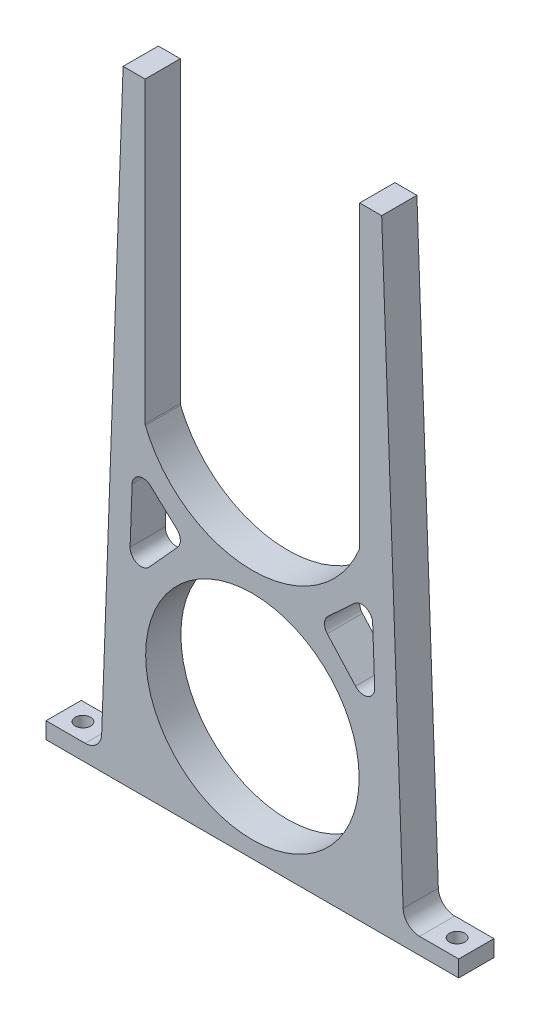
ISO-10303-21;
HEADER;
FILE_DESCRIPTION(('STEP AP214'),'2;1');
FILE_NAME('part.step','',(''),(''),'','','');
FILE_SCHEMA(('AUTOMOTIVE_DESIGN { 1 0 10303 214 1 1 1 1 }'));
ENDSEC;
DATA;
#1=APPLICATION_CONTEXT('core data for automotive mechanical design processes');
#2=APPLICATION_PROTOCOL_DEFINITION('international standard','automotive_design',2000,#1);
#3=PRODUCT_CONTEXT('',#1,'mechanical');
#4=PRODUCT('Part','Part','',(#3));
#5=PRODUCT_RELATED_PRODUCT_CATEGORY('part','',(#4));
#6=PRODUCT_DEFINITION_FORMATION('','',#4);
#7=PRODUCT_DEFINITION_CONTEXT('part definition',#1,'design');
#8=PRODUCT_DEFINITION('design','',#6,#7);
#9=PRODUCT_DEFINITION_SHAPE('','',#8);
#10=(LENGTH_UNIT() NAMED_UNIT(*) SI_UNIT(.MILLI.,.METRE.));
#11=(NAMED_UNIT(*) PLANE_ANGLE_UNIT() SI_UNIT($,.RADIAN.));
#12=(NAMED_UNIT(*) SI_UNIT($,.STERADIAN.) SOLID_ANGLE_UNIT());
#13=UNCERTAINTY_MEASURE_WITH_UNIT(LENGTH_MEASURE(1.E-05),#10,'distance_accuracy_value','');
#14=(GEOMETRIC_REPRESENTATION_CONTEXT(3) GLOBAL_UNCERTAINTY_ASSIGNED_CONTEXT((#13)) GLOBAL_UNIT_ASSIGNED_CONTEXT((#10,
#11,#12)) REPRESENTATION_CONTEXT('',''));
#15=CARTESIAN_POINT('',(0.,0.,0.));
#16=DIRECTION('',(0.,0.,1.));
#17=DIRECTION('',(1.,0.,0.));
#18=AXIS2_PLACEMENT_3D('',#15,#16,#17);
#19=CARTESIAN_POINT('',(0.,66.4,3.2));
#20=DIRECTION('',(0.,0.,-1.));
#21=DIRECTION('',(-1.,0.,0.));
#22=AXIS2_PLACEMENT_3D('',#19,#20,#21);
#23=PLANE('',#22);
#24=CARTESIAN_POINT('',(0.,22.4,3.2));
#25=DIRECTION('',(0.,0.,1.));
#26=DIRECTION('',(-1.,0.,0.));
#27=AXIS2_PLACEMENT_3D('',#24,#25,#26);
#28=CIRCLE('',#27,19.4);
#29=CARTESIAN_POINT('',(-19.4,22.4,3.2));
#30=VERTEX_POINT('',#29);
#31=EDGE_CURVE('E399',#30,#30,#28,.T.);
#32=ORIENTED_EDGE('',*,*,#31,.F.);
#33=EDGE_LOOP('',(#32));
#34=FACE_BOUND('',#33,.T.);
#35=DIRECTION('',(-1.,0.,0.));
#36=VECTOR('',#35,1.);
#37=CARTESIAN_POINT('',(37.5,3.,3.2));
#38=LINE('',#37,#36);
#39=CARTESIAN_POINT('',(37.5,3.,3.2));
#40=VERTEX_POINT('',#39);
#41=CARTESIAN_POINT('',(30.3928919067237,3.,3.2));
#42=VERTEX_POINT('',#41);
#43=EDGE_CURVE('E423',#40,#42,#38,.T.);
#44=ORIENTED_EDGE('',*,*,#43,.T.);
#45=CARTESIAN_POINT('',(30.3928919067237,6.,3.2));
#46=DIRECTION('',(0.,0.,-1.));
#47=DIRECTION('',(-1.,0.,0.));
#48=AXIS2_PLACEMENT_3D('',#45,#46,#47);
#49=CIRCLE('',#48,3.);
#50=CARTESIAN_POINT('',(27.3948734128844,5.89098114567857,3.2));
#51=VERTEX_POINT('',#50);
#52=EDGE_CURVE('E224',#42,#51,#49,.T.);
#53=ORIENTED_EDGE('',*,*,#52,.T.);
#54=DIRECTION('',(-0.036339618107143,0.999339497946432,0.));
#55=VECTOR('',#54,1.);
#56=CARTESIAN_POINT('',(27.5,3.,3.2));
#57=LINE('',#56,#55);
#58=CARTESIAN_POINT('',(23.5,113.,3.2));
#59=VERTEX_POINT('',#58);
#60=EDGE_CURVE('E216',#51,#59,#57,.T.);
#61=ORIENTED_EDGE('',*,*,#60,.T.);
#62=DIRECTION('',(-1.,0.,0.));
#63=VECTOR('',#62,1.);
#64=CARTESIAN_POINT('',(23.5,113.,3.2));
#65=LINE('',#64,#63);
#66=CARTESIAN_POINT('',(19.5,113.,3.2));
#67=VERTEX_POINT('',#66);
#68=EDGE_CURVE('E221',#59,#67,#65,.T.);
#69=ORIENTED_EDGE('',*,*,#68,.T.);
#70=DIRECTION('',(0.,-1.,0.));
#71=VECTOR('',#70,1.);
#72=CARTESIAN_POINT('',(19.5,113.,3.2));
#73=LINE('',#72,#71);
#74=CARTESIAN_POINT('',(19.5,58.7416712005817,3.2));
#75=VERTEX_POINT('',#74);
#76=EDGE_CURVE('E238',#67,#75,#73,.T.);
#77=ORIENTED_EDGE('',*,*,#76,.T.);
#78=CARTESIAN_POINT('',(18.8,58.7416712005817,3.2));
#79=DIRECTION('',(0.,0.,-1.));
#80=DIRECTION('',(-1.,0.,0.));
#81=AXIS2_PLACEMENT_3D('',#78,#79,#80);
#82=CIRCLE('',#81,0.7);
#83=CARTESIAN_POINT('',(19.448275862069,58.4775908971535,3.2));
#84=VERTEX_POINT('',#83);
#85=EDGE_CURVE('E261',#75,#84,#82,.T.);
#86=ORIENTED_EDGE('',*,*,#85,.T.);
#87=CARTESIAN_POINT('',(0.,66.4,3.2));
#88=DIRECTION('',(0.,0.,-1.));
#89=DIRECTION('',(-1.,0.,0.));
#90=AXIS2_PLACEMENT_3D('',#87,#88,#89);
#91=CIRCLE('',#90,21.);
#92=CARTESIAN_POINT('',(-19.448275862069,58.4775908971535,3.2));
#93=VERTEX_POINT('',#92);
#94=EDGE_CURVE('E405',#84,#93,#91,.T.);
#95=ORIENTED_EDGE('',*,*,#94,.T.);
#96=CARTESIAN_POINT('',(-18.8,58.7416712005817,3.2));
#97=DIRECTION('',(0.,0.,-1.));
#98=DIRECTION('',(-1.,0.,0.));
#99=AXIS2_PLACEMENT_3D('',#96,#97,#98);
#100=CIRCLE('',#99,0.7);
#101=CARTESIAN_POINT('',(-19.5,58.7416712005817,3.2));
#102=VERTEX_POINT('',#101);
#103=EDGE_CURVE('E265',#93,#102,#100,.T.);
#104=ORIENTED_EDGE('',*,*,#103,.T.);
#105=DIRECTION('',(0.,1.,0.));
#106=VECTOR('',#105,1.);
#107=CARTESIAN_POINT('',(-19.5,113.,3.2));
#108=LINE('',#107,#106);
#109=CARTESIAN_POINT('',(-19.5,113.,3.2));
#110=VERTEX_POINT('',#109);
#111=EDGE_CURVE('E408',#102,#110,#108,.T.);
#112=ORIENTED_EDGE('',*,*,#111,.T.);
#113=DIRECTION('',(-1.,0.,0.));
#114=VECTOR('',#113,1.);
#115=CARTESIAN_POINT('',(-23.5,113.,3.2));
#116=LINE('',#115,#114);
#117=CARTESIAN_POINT('',(-23.5,113.,3.2));
#118=VERTEX_POINT('',#117);
#119=EDGE_CURVE('E410',#110,#118,#116,.T.);
#120=ORIENTED_EDGE('',*,*,#119,.T.);
#121=DIRECTION('',(-0.036339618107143,-0.999339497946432,0.));
#122=VECTOR('',#121,1.);
#123=CARTESIAN_POINT('',(-27.5,3.,3.2));
#124=LINE('',#123,#122);
#125=CARTESIAN_POINT('',(-27.3948734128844,5.89098114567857,3.2));
#126=VERTEX_POINT('',#125);
#127=EDGE_CURVE('E412',#118,#126,#124,.T.);
#128=ORIENTED_EDGE('',*,*,#127,.T.);
#129=CARTESIAN_POINT('',(-30.3928919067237,6.,3.2));
#130=DIRECTION('',(0.,0.,-1.));
#131=DIRECTION('',(-1.,0.,0.));
#132=AXIS2_PLACEMENT_3D('',#129,#130,#131);
#133=CIRCLE('',#132,3.);
#134=CARTESIAN_POINT('',(-30.3928919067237,3.,3.2));
#135=VERTEX_POINT('',#134);
#136=EDGE_CURVE('E281',#126,#135,#133,.T.);
#137=ORIENTED_EDGE('',*,*,#136,.T.);
#138=DIRECTION('',(-1.,0.,0.));
#139=VECTOR('',#138,1.);
#140=CARTESIAN_POINT('',(-37.5,3.,3.2));
#141=LINE('',#140,#139);
#142=CARTESIAN_POINT('',(-37.5,3.,3.2));
#143=VERTEX_POINT('',#142);
#144=EDGE_CURVE('E415',#135,#143,#141,.T.);
#145=ORIENTED_EDGE('',*,*,#144,.T.);
#146=DIRECTION('',(0.,-1.,0.));
#147=VECTOR('',#146,1.);
#148=CARTESIAN_POINT('',(-37.5,0.,3.2));
#149=LINE('',#148,#147);
#150=CARTESIAN_POINT('',(-37.5,0.,3.2));
#151=VERTEX_POINT('',#150);
#152=EDGE_CURVE('E417',#143,#151,#149,.T.);
#153=ORIENTED_EDGE('',*,*,#152,.T.);
#154=DIRECTION('',(1.,0.,0.));
#155=VECTOR('',#154,1.);
#156=CARTESIAN_POINT('',(-37.5,0.,3.2));
#157=LINE('',#156,#155);
#158=CARTESIAN_POINT('',(37.5,0.,3.2));
#159=VERTEX_POINT('',#158);
#160=EDGE_CURVE('E419',#151,#159,#157,.T.);
#161=ORIENTED_EDGE('',*,*,#160,.T.);
#162=DIRECTION('',(0.,1.,0.));
#163=VECTOR('',#162,1.);
#164=CARTESIAN_POINT('',(37.5,0.,3.2));
#165=LINE('',#164,#163);
#166=EDGE_CURVE('E421',#159,#40,#165,.T.);
#167=ORIENTED_EDGE('',*,*,#166,.T.);
#168=EDGE_LOOP('',(#44,#53,#61,#69,#77,#86,#95,#104,#112,#120,#128,#137,#145,#153,#161,#167));
#169=FACE_BOUND('',#168,.T.);
#170=DIRECTION('',(0.733470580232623,0.679721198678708,0.));
#171=VECTOR('',#170,1.);
#172=CARTESIAN_POINT('',(16.9930299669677,48.0632354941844,3.2));
#173=LINE('',#172,#171);
#174=CARTESIAN_POINT('',(13.7351859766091,45.0441292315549,3.2));
#175=VERTEX_POINT('',#174);
#176=CARTESIAN_POINT('',(18.5004730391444,49.4602117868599,3.2));
#177=VERTEX_POINT('',#176);
#178=EDGE_CURVE('E380',#175,#177,#173,.T.);
#179=ORIENTED_EDGE('',*,*,#178,.T.);
#180=CARTESIAN_POINT('',(19.8599154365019,47.9932706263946,3.2));
#181=DIRECTION('',(0.,0.,-1.));
#182=DIRECTION('',(-1.,0.,0.));
#183=AXIS2_PLACEMENT_3D('',#180,#181,#182);
#184=CIRCLE('',#183,2.);
#185=CARTESIAN_POINT('',(21.8585944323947,48.0659498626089,3.2));
#186=VERTEX_POINT('',#185);
#187=EDGE_CURVE('E311',#177,#186,#184,.T.);
#188=ORIENTED_EDGE('',*,*,#187,.T.);
#189=DIRECTION('',(0.0363396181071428,-0.999339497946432,0.));
#190=VECTOR('',#189,1.);
#191=CARTESIAN_POINT('',(21.1639163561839,67.1695969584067,3.2));
#192=LINE('',#191,#190);
#193=CARTESIAN_POINT('',(22.2255450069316,37.9748090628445,3.2));
#194=VERTEX_POINT('',#193);
#195=EDGE_CURVE('E360',#186,#194,#192,.T.);
#196=ORIENTED_EDGE('',*,*,#195,.T.);
#197=CARTESIAN_POINT('',(20.2268660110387,37.9021298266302,3.2));
#198=DIRECTION('',(0.,0.,-1.));
#199=DIRECTION('',(-1.,0.,0.));
#200=AXIS2_PLACEMENT_3D('',#197,#198,#199);
#201=CIRCLE('',#200,2.);
#202=CARTESIAN_POINT('',(18.7434903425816,36.5606393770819,3.2));
#203=VERTEX_POINT('',#202);
#204=EDGE_CURVE('E307',#194,#203,#201,.T.);
#205=ORIENTED_EDGE('',*,*,#204,.T.);
#206=DIRECTION('',(-0.670745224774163,0.741687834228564,0.));
#207=VECTOR('',#206,1.);
#208=CARTESIAN_POINT('',(-4.53378189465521,62.2998753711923,3.2));
#209=LINE('',#208,#207);
#210=CARTESIAN_POINT('',(13.6112527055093,42.2356976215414,3.2));
#211=VERTEX_POINT('',#210);
#212=EDGE_CURVE('E383',#203,#211,#209,.T.);
#213=ORIENTED_EDGE('',*,*,#212,.T.);
#214=CARTESIAN_POINT('',(15.0946283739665,43.5771880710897,3.2));
#215=DIRECTION('',(0.,0.,-1.));
#216=DIRECTION('',(-1.,0.,0.));
#217=AXIS2_PLACEMENT_3D('',#214,#215,#216);
#218=CIRCLE('',#217,2.);
#219=EDGE_CURVE('E315',#211,#175,#218,.T.);
#220=ORIENTED_EDGE('',*,*,#219,.T.);
#221=EDGE_LOOP('',(#179,#188,#196,#205,#213,#220));
#222=FACE_BOUND('',#221,.T.);
#223=DIRECTION('',(0.670745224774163,0.741687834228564,0.));
#224=VECTOR('',#223,1.);
#225=CARTESIAN_POINT('',(4.53378189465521,62.2998753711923,3.2));
#226=LINE('',#225,#224);
#227=CARTESIAN_POINT('',(-18.7434903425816,36.5606393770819,3.2));
#228=VERTEX_POINT('',#227);
#229=CARTESIAN_POINT('',(-13.6112527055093,42.2356976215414,3.2));
#230=VERTEX_POINT('',#229);
#231=EDGE_CURVE('E351',#228,#230,#226,.T.);
#232=ORIENTED_EDGE('',*,*,#231,.F.);
#233=CARTESIAN_POINT('',(-20.2268660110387,37.9021298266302,3.2));
#234=DIRECTION('',(0.,0.,-1.));
#235=DIRECTION('',(-1.,0.,0.));
#236=AXIS2_PLACEMENT_3D('',#233,#234,#235);
#237=CIRCLE('',#236,2.);
#238=CARTESIAN_POINT('',(-22.2255450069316,37.9748090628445,3.2));
#239=VERTEX_POINT('',#238);
#240=EDGE_CURVE('E340',#228,#239,#237,.T.);
#241=ORIENTED_EDGE('',*,*,#240,.T.);
#242=DIRECTION('',(-0.0363396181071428,-0.999339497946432,0.));
#243=VECTOR('',#242,1.);
#244=CARTESIAN_POINT('',(-21.1639163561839,67.1695969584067,3.2));
#245=LINE('',#244,#243);
#246=CARTESIAN_POINT('',(-21.8585944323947,48.0659498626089,3.2));
#247=VERTEX_POINT('',#246);
#248=EDGE_CURVE('E361',#247,#239,#245,.T.);
#249=ORIENTED_EDGE('',*,*,#248,.F.);
#250=CARTESIAN_POINT('',(-19.8599154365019,47.9932706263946,3.2));
#251=DIRECTION('',(0.,0.,-1.));
#252=DIRECTION('',(-1.,0.,0.));
#253=AXIS2_PLACEMENT_3D('',#250,#251,#252);
#254=CIRCLE('',#253,2.);
#255=CARTESIAN_POINT('',(-18.5004730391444,49.4602117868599,3.2));
#256=VERTEX_POINT('',#255);
#257=EDGE_CURVE('E344',#247,#256,#254,.T.);
#258=ORIENTED_EDGE('',*,*,#257,.T.);
#259=DIRECTION('',(-0.733470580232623,0.679721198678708,0.));
#260=VECTOR('',#259,1.);
#261=CARTESIAN_POINT('',(-16.9930299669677,48.0632354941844,3.2));
#262=LINE('',#261,#260);
#263=CARTESIAN_POINT('',(-13.7351859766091,45.0441292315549,3.2));
#264=VERTEX_POINT('',#263);
#265=EDGE_CURVE('E352',#264,#256,#262,.T.);
#266=ORIENTED_EDGE('',*,*,#265,.F.);
#267=CARTESIAN_POINT('',(-15.0946283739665,43.5771880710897,3.2));
#268=DIRECTION('',(0.,0.,-1.));
#269=DIRECTION('',(-1.,0.,0.));
#270=AXIS2_PLACEMENT_3D('',#267,#268,#269);
#271=CIRCLE('',#270,2.);
#272=EDGE_CURVE('E40',#264,#230,#271,.T.);
#273=ORIENTED_EDGE('',*,*,#272,.T.);
#274=EDGE_LOOP('',(#232,#241,#249,#258,#266,#273));
#275=FACE_BOUND('',#274,.T.);
#276=ADVANCED_FACE('F32',(#34,#169,#222,#275),#23,.F.);
#277=CARTESIAN_POINT('',(0.,66.4,-3.2));
#278=DIRECTION('',(0.,0.,-1.));
#279=DIRECTION('',(-1.,0.,0.));
#280=AXIS2_PLACEMENT_3D('',#277,#278,#279);
#281=PLANE('',#280);
#282=CARTESIAN_POINT('',(0.,22.4,-3.2));
#283=DIRECTION('',(0.,0.,1.));
#284=DIRECTION('',(-1.,0.,0.));
#285=AXIS2_PLACEMENT_3D('',#282,#283,#284);
#286=CIRCLE('',#285,19.4);
#287=CARTESIAN_POINT('',(-19.4,22.4,-3.2));
#288=VERTEX_POINT('',#287);
#289=EDGE_CURVE('E398',#288,#288,#286,.T.);
#290=ORIENTED_EDGE('',*,*,#289,.T.);
#291=EDGE_LOOP('',(#290));
#292=FACE_BOUND('',#291,.T.);
#293=DIRECTION('',(-0.036339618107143,0.999339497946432,0.));
#294=VECTOR('',#293,1.);
#295=CARTESIAN_POINT('',(27.5,3.,-3.2));
#296=LINE('',#295,#294);
#297=CARTESIAN_POINT('',(27.3948734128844,5.89098114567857,-3.2));
#298=VERTEX_POINT('',#297);
#299=CARTESIAN_POINT('',(23.5,113.,-3.2));
#300=VERTEX_POINT('',#299);
#301=EDGE_CURVE('E242',#298,#300,#296,.T.);
#302=ORIENTED_EDGE('',*,*,#301,.F.);
#303=CARTESIAN_POINT('',(30.3928919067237,6.,-3.2));
#304=DIRECTION('',(0.,0.,-1.));
#305=DIRECTION('',(-1.,0.,0.));
#306=AXIS2_PLACEMENT_3D('',#303,#304,#305);
#307=CIRCLE('',#306,3.);
#308=CARTESIAN_POINT('',(30.3928919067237,3.,-3.2));
#309=VERTEX_POINT('',#308);
#310=EDGE_CURVE('E276',#298,#309,#307,.F.);
#311=ORIENTED_EDGE('',*,*,#310,.T.);
#312=DIRECTION('',(-1.,0.,0.));
#313=VECTOR('',#312,1.);
#314=CARTESIAN_POINT('',(37.5,3.,-3.2));
#315=LINE('',#314,#313);
#316=CARTESIAN_POINT('',(37.5,3.,-3.2));
#317=VERTEX_POINT('',#316);
#318=EDGE_CURVE('E229',#317,#309,#315,.T.);
#319=ORIENTED_EDGE('',*,*,#318,.F.);
#320=DIRECTION('',(0.,1.,0.));
#321=VECTOR('',#320,1.);
#322=CARTESIAN_POINT('',(37.5,0.,-3.2));
#323=LINE('',#322,#321);
#324=CARTESIAN_POINT('',(37.5,0.,-3.2));
#325=VERTEX_POINT('',#324);
#326=EDGE_CURVE('E448',#325,#317,#323,.T.);
#327=ORIENTED_EDGE('',*,*,#326,.F.);
#328=DIRECTION('',(1.,0.,0.));
#329=VECTOR('',#328,1.);
#330=CARTESIAN_POINT('',(-37.5,0.,-3.2));
#331=LINE('',#330,#329);
#332=CARTESIAN_POINT('',(-37.5,0.,-3.2));
#333=VERTEX_POINT('',#332);
#334=EDGE_CURVE('E446',#333,#325,#331,.T.);
#335=ORIENTED_EDGE('',*,*,#334,.F.);
#336=DIRECTION('',(0.,-1.,0.));
#337=VECTOR('',#336,1.);
#338=CARTESIAN_POINT('',(-37.5,0.,-3.2));
#339=LINE('',#338,#337);
#340=CARTESIAN_POINT('',(-37.5,3.,-3.2));
#341=VERTEX_POINT('',#340);
#342=EDGE_CURVE('E444',#341,#333,#339,.T.);
#343=ORIENTED_EDGE('',*,*,#342,.F.);
#344=DIRECTION('',(-1.,0.,0.));
#345=VECTOR('',#344,1.);
#346=CARTESIAN_POINT('',(-37.5,3.,-3.2));
#347=LINE('',#346,#345);
#348=CARTESIAN_POINT('',(-30.3928919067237,3.,-3.2));
#349=VERTEX_POINT('',#348);
#350=EDGE_CURVE('E442',#349,#341,#347,.T.);
#351=ORIENTED_EDGE('',*,*,#350,.F.);
#352=CARTESIAN_POINT('',(-30.3928919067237,6.,-3.2));
#353=DIRECTION('',(0.,0.,-1.));
#354=DIRECTION('',(-1.,0.,0.));
#355=AXIS2_PLACEMENT_3D('',#352,#353,#354);
#356=CIRCLE('',#355,3.);
#357=CARTESIAN_POINT('',(-27.3948734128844,5.89098114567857,-3.2));
#358=VERTEX_POINT('',#357);
#359=EDGE_CURVE('E279',#349,#358,#356,.F.);
#360=ORIENTED_EDGE('',*,*,#359,.T.);
#361=DIRECTION('',(-0.036339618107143,-0.999339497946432,0.));
#362=VECTOR('',#361,1.);
#363=CARTESIAN_POINT('',(-27.5,3.,-3.2));
#364=LINE('',#363,#362);
#365=CARTESIAN_POINT('',(-23.5,113.,-3.2));
#366=VERTEX_POINT('',#365);
#367=EDGE_CURVE('E439',#366,#358,#364,.T.);
#368=ORIENTED_EDGE('',*,*,#367,.F.);
#369=DIRECTION('',(-1.,0.,0.));
#370=VECTOR('',#369,1.);
#371=CARTESIAN_POINT('',(-23.5,113.,-3.2));
#372=LINE('',#371,#370);
#373=CARTESIAN_POINT('',(-19.5,113.,-3.2));
#374=VERTEX_POINT('',#373);
#375=EDGE_CURVE('E437',#374,#366,#372,.T.);
#376=ORIENTED_EDGE('',*,*,#375,.F.);
#377=DIRECTION('',(0.,1.,0.));
#378=VECTOR('',#377,1.);
#379=CARTESIAN_POINT('',(-19.5,113.,-3.2));
#380=LINE('',#379,#378);
#381=CARTESIAN_POINT('',(-19.5,58.7416712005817,-3.2));
#382=VERTEX_POINT('',#381);
#383=EDGE_CURVE('E435',#382,#374,#380,.T.);
#384=ORIENTED_EDGE('',*,*,#383,.F.);
#385=CARTESIAN_POINT('',(-18.8,58.7416712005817,-3.2));
#386=DIRECTION('',(0.,0.,-1.));
#387=DIRECTION('',(-1.,0.,0.));
#388=AXIS2_PLACEMENT_3D('',#385,#386,#387);
#389=CIRCLE('',#388,0.7);
#390=CARTESIAN_POINT('',(-19.448275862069,58.4775908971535,-3.2));
#391=VERTEX_POINT('',#390);
#392=EDGE_CURVE('E263',#382,#391,#389,.F.);
#393=ORIENTED_EDGE('',*,*,#392,.T.);
#394=CARTESIAN_POINT('',(0.,66.4,-3.2));
#395=DIRECTION('',(0.,0.,-1.));
#396=DIRECTION('',(-1.,0.,0.));
#397=AXIS2_PLACEMENT_3D('',#394,#395,#396);
#398=CIRCLE('',#397,21.);
#399=CARTESIAN_POINT('',(19.448275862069,58.4775908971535,-3.2));
#400=VERTEX_POINT('',#399);
#401=EDGE_CURVE('E432',#400,#391,#398,.T.);
#402=ORIENTED_EDGE('',*,*,#401,.F.);
#403=CARTESIAN_POINT('',(18.8,58.7416712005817,-3.2));
#404=DIRECTION('',(0.,0.,-1.));
#405=DIRECTION('',(-1.,0.,0.));
#406=AXIS2_PLACEMENT_3D('',#403,#404,#405);
#407=CIRCLE('',#406,0.7);
#408=CARTESIAN_POINT('',(19.5,58.7416712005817,-3.2));
#409=VERTEX_POINT('',#408);
#410=EDGE_CURVE('E259',#400,#409,#407,.F.);
#411=ORIENTED_EDGE('',*,*,#410,.T.);
#412=DIRECTION('',(0.,-1.,0.));
#413=VECTOR('',#412,1.);
#414=CARTESIAN_POINT('',(19.5,113.,-3.2));
#415=LINE('',#414,#413);
#416=CARTESIAN_POINT('',(19.5,113.,-3.2));
#417=VERTEX_POINT('',#416);
#418=EDGE_CURVE('E429',#417,#409,#415,.T.);
#419=ORIENTED_EDGE('',*,*,#418,.F.);
#420=DIRECTION('',(-1.,0.,0.));
#421=VECTOR('',#420,1.);
#422=CARTESIAN_POINT('',(23.5,113.,-3.2));
#423=LINE('',#422,#421);
#424=EDGE_CURVE('E427',#300,#417,#423,.T.);
#425=ORIENTED_EDGE('',*,*,#424,.F.);
#426=EDGE_LOOP('',(#302,#311,#319,#327,#335,#343,#351,#360,#368,#376,#384,#393,#402,#411,#419,#425));
#427=FACE_BOUND('',#426,.T.);
#428=DIRECTION('',(-0.670745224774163,0.741687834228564,0.));
#429=VECTOR('',#428,1.);
#430=CARTESIAN_POINT('',(-4.53378189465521,62.2998753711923,-3.2));
#431=LINE('',#430,#429);
#432=CARTESIAN_POINT('',(18.7434903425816,36.5606393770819,-3.2));
#433=VERTEX_POINT('',#432);
#434=CARTESIAN_POINT('',(13.6112527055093,42.2356976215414,-3.2));
#435=VERTEX_POINT('',#434);
#436=EDGE_CURVE('E289',#433,#435,#431,.T.);
#437=ORIENTED_EDGE('',*,*,#436,.F.);
#438=CARTESIAN_POINT('',(20.2268660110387,37.9021298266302,-3.2));
#439=DIRECTION('',(0.,0.,-1.));
#440=DIRECTION('',(-1.,0.,0.));
#441=AXIS2_PLACEMENT_3D('',#438,#439,#440);
#442=CIRCLE('',#441,2.);
#443=CARTESIAN_POINT('',(22.2255450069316,37.9748090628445,-3.2));
#444=VERTEX_POINT('',#443);
#445=EDGE_CURVE('E309',#433,#444,#442,.F.);
#446=ORIENTED_EDGE('',*,*,#445,.T.);
#447=DIRECTION('',(0.0363396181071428,-0.999339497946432,0.));
#448=VECTOR('',#447,1.);
#449=CARTESIAN_POINT('',(21.1639163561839,67.1695969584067,-3.2));
#450=LINE('',#449,#448);
#451=CARTESIAN_POINT('',(21.8585944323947,48.0659498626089,-3.2));
#452=VERTEX_POINT('',#451);
#453=EDGE_CURVE('E283',#452,#444,#450,.T.);
#454=ORIENTED_EDGE('',*,*,#453,.F.);
#455=CARTESIAN_POINT('',(19.8599154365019,47.9932706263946,-3.2));
#456=DIRECTION('',(0.,0.,-1.));
#457=DIRECTION('',(-1.,0.,0.));
#458=AXIS2_PLACEMENT_3D('',#455,#456,#457);
#459=CIRCLE('',#458,2.);
#460=CARTESIAN_POINT('',(18.5004730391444,49.4602117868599,-3.2));
#461=VERTEX_POINT('',#460);
#462=EDGE_CURVE('E313',#452,#461,#459,.F.);
#463=ORIENTED_EDGE('',*,*,#462,.T.);
#464=DIRECTION('',(0.733470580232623,0.679721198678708,0.));
#465=VECTOR('',#464,1.);
#466=CARTESIAN_POINT('',(16.9930299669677,48.0632354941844,-3.2));
#467=LINE('',#466,#465);
#468=CARTESIAN_POINT('',(13.7351859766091,45.0441292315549,-3.2));
#469=VERTEX_POINT('',#468);
#470=EDGE_CURVE('E286',#469,#461,#467,.T.);
#471=ORIENTED_EDGE('',*,*,#470,.F.);
#472=CARTESIAN_POINT('',(15.0946283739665,43.5771880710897,-3.2));
#473=DIRECTION('',(0.,0.,-1.));
#474=DIRECTION('',(-1.,0.,0.));
#475=AXIS2_PLACEMENT_3D('',#472,#473,#474);
#476=CIRCLE('',#475,2.);
#477=EDGE_CURVE('E317',#469,#435,#476,.F.);
#478=ORIENTED_EDGE('',*,*,#477,.T.);
#479=EDGE_LOOP('',(#437,#446,#454,#463,#471,#478));
#480=FACE_BOUND('',#479,.T.);
#481=DIRECTION('',(-0.733470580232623,0.679721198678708,0.));
#482=VECTOR('',#481,1.);
#483=CARTESIAN_POINT('',(-16.9930299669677,48.0632354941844,-3.2));
#484=LINE('',#483,#482);
#485=CARTESIAN_POINT('',(-13.7351859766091,45.0441292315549,-3.2));
#486=VERTEX_POINT('',#485);
#487=CARTESIAN_POINT('',(-18.5004730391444,49.4602117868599,-3.2));
#488=VERTEX_POINT('',#487);
#489=EDGE_CURVE('E319',#486,#488,#484,.T.);
#490=ORIENTED_EDGE('',*,*,#489,.T.);
#491=CARTESIAN_POINT('',(-19.8599154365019,47.9932706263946,-3.2));
#492=DIRECTION('',(0.,0.,-1.));
#493=DIRECTION('',(-1.,0.,0.));
#494=AXIS2_PLACEMENT_3D('',#491,#492,#493);
#495=CIRCLE('',#494,2.);
#496=CARTESIAN_POINT('',(-21.8585944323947,48.0659498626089,-3.2));
#497=VERTEX_POINT('',#496);
#498=EDGE_CURVE('E346',#488,#497,#495,.F.);
#499=ORIENTED_EDGE('',*,*,#498,.T.);
#500=DIRECTION('',(-0.0363396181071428,-0.999339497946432,0.));
#501=VECTOR('',#500,1.);
#502=CARTESIAN_POINT('',(-21.1639163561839,67.1695969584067,-3.2));
#503=LINE('',#502,#501);
#504=CARTESIAN_POINT('',(-22.2255450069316,37.9748090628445,-3.2));
#505=VERTEX_POINT('',#504);
#506=EDGE_CURVE('E321',#497,#505,#503,.T.);
#507=ORIENTED_EDGE('',*,*,#506,.T.);
#508=CARTESIAN_POINT('',(-20.2268660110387,37.9021298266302,-3.2));
#509=DIRECTION('',(0.,0.,-1.));
#510=DIRECTION('',(-1.,0.,0.));
#511=AXIS2_PLACEMENT_3D('',#508,#509,#510);
#512=CIRCLE('',#511,2.);
#513=CARTESIAN_POINT('',(-18.7434903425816,36.5606393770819,-3.2));
#514=VERTEX_POINT('',#513);
#515=EDGE_CURVE('E342',#505,#514,#512,.F.);
#516=ORIENTED_EDGE('',*,*,#515,.T.);
#517=DIRECTION('',(0.670745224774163,0.741687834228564,0.));
#518=VECTOR('',#517,1.);
#519=CARTESIAN_POINT('',(4.53378189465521,62.2998753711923,-3.2));
#520=LINE('',#519,#518);
#521=CARTESIAN_POINT('',(-13.6112527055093,42.2356976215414,-3.2));
#522=VERTEX_POINT('',#521);
#523=EDGE_CURVE('E324',#514,#522,#520,.T.);
#524=ORIENTED_EDGE('',*,*,#523,.T.);
#525=CARTESIAN_POINT('',(-15.0946283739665,43.5771880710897,-3.2));
#526=DIRECTION('',(0.,0.,-1.));
#527=DIRECTION('',(-1.,0.,0.));
#528=AXIS2_PLACEMENT_3D('',#525,#526,#527);
#529=CIRCLE('',#528,2.);
#530=EDGE_CURVE('E11',#522,#486,#529,.F.);
#531=ORIENTED_EDGE('',*,*,#530,.T.);
#532=EDGE_LOOP('',(#490,#499,#507,#516,#524,#531));
#533=FACE_BOUND('',#532,.T.);
#534=ADVANCED_FACE('F365',(#292,#427,#480,#533),#281,.T.);
#535=CARTESIAN_POINT('',(-37.5,0.,3.2));
#536=DIRECTION('',(0.,1.,0.));
#537=DIRECTION('',(0.,0.,1.));
#538=AXIS2_PLACEMENT_3D('',#535,#536,#537);
#539=PLANE('',#538);
#540=CARTESIAN_POINT('',(34.,0.,0.));
#541=DIRECTION('',(0.,1.,0.));
#542=DIRECTION('',(0.,0.,1.));
#543=AXIS2_PLACEMENT_3D('',#540,#541,#542);
#544=CIRCLE('',#543,1.4);
#545=CARTESIAN_POINT('',(34.,0.,1.4));
#546=VERTEX_POINT('',#545);
#547=EDGE_CURVE('E395',#546,#546,#544,.T.);
#548=ORIENTED_EDGE('',*,*,#547,.T.);
#549=EDGE_LOOP('',(#548));
#550=FACE_BOUND('',#549,.T.);
#551=ORIENTED_EDGE('',*,*,#334,.T.);
#552=DIRECTION('',(0.,0.,-1.));
#553=VECTOR('',#552,1.);
#554=CARTESIAN_POINT('',(37.5,0.,3.2));
#555=LINE('',#554,#553);
#556=EDGE_CURVE('E454',#159,#325,#555,.T.);
#557=ORIENTED_EDGE('',*,*,#556,.F.);
#558=ORIENTED_EDGE('',*,*,#160,.F.);
#559=DIRECTION('',(0.,0.,-1.));
#560=VECTOR('',#559,1.);
#561=CARTESIAN_POINT('',(-37.5,0.,3.2));
#562=LINE('',#561,#560);
#563=EDGE_CURVE('E457',#151,#333,#562,.T.);
#564=ORIENTED_EDGE('',*,*,#563,.T.);
#565=EDGE_LOOP('',(#551,#557,#558,#564));
#566=FACE_BOUND('',#565,.T.);
#567=CARTESIAN_POINT('',(-34.,0.,0.));
#568=DIRECTION('',(0.,-1.,0.));
#569=DIRECTION('',(0.,0.,1.));
#570=AXIS2_PLACEMENT_3D('',#567,#568,#569);
#571=CIRCLE('',#570,1.4);
#572=CARTESIAN_POINT('',(-34.,0.,1.4));
#573=VERTEX_POINT('',#572);
#574=EDGE_CURVE('E389',#573,#573,#571,.T.);
#575=ORIENTED_EDGE('',*,*,#574,.F.);
#576=EDGE_LOOP('',(#575));
#577=FACE_BOUND('',#576,.T.);
#578=ADVANCED_FACE('F502',(#550,#566,#577),#539,.F.);
#579=CARTESIAN_POINT('',(-37.5,3.,3.2));
#580=DIRECTION('',(0.,-1.,0.));
#581=DIRECTION('',(1.,0.,0.));
#582=AXIS2_PLACEMENT_3D('',#579,#580,#581);
#583=PLANE('',#582);
#584=ORIENTED_EDGE('',*,*,#144,.F.);
#585=DIRECTION('',(0.,0.,-1.));
#586=VECTOR('',#585,1.);
#587=CARTESIAN_POINT('',(-30.3928919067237,3.,-3.2));
#588=LINE('',#587,#586);
#589=EDGE_CURVE('E271',#135,#349,#588,.T.);
#590=ORIENTED_EDGE('',*,*,#589,.T.);
#591=ORIENTED_EDGE('',*,*,#350,.T.);
#592=DIRECTION('',(0.,0.,-1.));
#593=VECTOR('',#592,1.);
#594=CARTESIAN_POINT('',(-37.5,3.,3.2));
#595=LINE('',#594,#593);
#596=EDGE_CURVE('E460',#143,#341,#595,.T.);
#597=ORIENTED_EDGE('',*,*,#596,.F.);
#598=EDGE_LOOP('',(#584,#590,#591,#597));
#599=FACE_BOUND('',#598,.T.);
#600=CARTESIAN_POINT('',(-34.,3.,0.));
#601=DIRECTION('',(0.,-1.,0.));
#602=DIRECTION('',(0.,0.,1.));
#603=AXIS2_PLACEMENT_3D('',#600,#601,#602);
#604=CIRCLE('',#603,1.4);
#605=CARTESIAN_POINT('',(-34.,3.,1.4));
#606=VERTEX_POINT('',#605);
#607=EDGE_CURVE('E386',#606,#606,#604,.T.);
#608=ORIENTED_EDGE('',*,*,#607,.T.);
#609=EDGE_LOOP('',(#608));
#610=FACE_BOUND('',#609,.T.);
#611=ADVANCED_FACE('F490',(#599,#610),#583,.F.);
#612=CARTESIAN_POINT('',(37.5,3.,3.2));
#613=DIRECTION('',(0.,-1.,0.));
#614=DIRECTION('',(1.,0.,0.));
#615=AXIS2_PLACEMENT_3D('',#612,#613,#614);
#616=PLANE('',#615);
#617=ORIENTED_EDGE('',*,*,#318,.T.);
#618=DIRECTION('',(0.,0.,-1.));
#619=VECTOR('',#618,1.);
#620=CARTESIAN_POINT('',(30.3928919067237,3.,3.2));
#621=LINE('',#620,#619);
#622=EDGE_CURVE('E269',#309,#42,#621,.F.);
#623=ORIENTED_EDGE('',*,*,#622,.T.);
#624=ORIENTED_EDGE('',*,*,#43,.F.);
#625=DIRECTION('',(0.,0.,-1.));
#626=VECTOR('',#625,1.);
#627=CARTESIAN_POINT('',(37.5,3.,3.2));
#628=LINE('',#627,#626);
#629=EDGE_CURVE('E425',#40,#317,#628,.T.);
#630=ORIENTED_EDGE('',*,*,#629,.T.);
#631=EDGE_LOOP('',(#617,#623,#624,#630));
#632=FACE_BOUND('',#631,.T.);
#633=CARTESIAN_POINT('',(34.,3.,0.));
#634=DIRECTION('',(0.,1.,0.));
#635=DIRECTION('',(0.,0.,1.));
#636=AXIS2_PLACEMENT_3D('',#633,#634,#635);
#637=CIRCLE('',#636,1.4);
#638=CARTESIAN_POINT('',(34.,3.,1.4));
#639=VERTEX_POINT('',#638);
#640=EDGE_CURVE('E392',#639,#639,#637,.T.);
#641=ORIENTED_EDGE('',*,*,#640,.F.);
#642=EDGE_LOOP('',(#641));
#643=FACE_BOUND('',#642,.T.);
#644=ADVANCED_FACE('F511',(#632,#643),#616,.F.);
#645=CARTESIAN_POINT('',(27.5,3.,3.2));
#646=DIRECTION('',(-0.999339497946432,-0.036339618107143,0.));
#647=DIRECTION('',(0.036339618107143,-0.999339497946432,0.));
#648=AXIS2_PLACEMENT_3D('',#645,#646,#647);
#649=PLANE('',#648);
#650=ORIENTED_EDGE('',*,*,#60,.F.);
#651=DIRECTION('',(0.,0.,-1.));
#652=VECTOR('',#651,1.);
#653=CARTESIAN_POINT('',(27.3948734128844,5.89098114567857,-3.2));
#654=LINE('',#653,#652);
#655=EDGE_CURVE('E267',#51,#298,#654,.T.);
#656=ORIENTED_EDGE('',*,*,#655,.T.);
#657=ORIENTED_EDGE('',*,*,#301,.T.);
#658=DIRECTION('',(0.,0.,-1.));
#659=VECTOR('',#658,1.);
#660=CARTESIAN_POINT('',(23.5,113.,3.2));
#661=LINE('',#660,#659);
#662=EDGE_CURVE('E234',#59,#300,#661,.T.);
#663=ORIENTED_EDGE('',*,*,#662,.F.);
#664=EDGE_LOOP('',(#650,#656,#657,#663));
#665=FACE_BOUND('',#664,.T.);
#666=ADVANCED_FACE('F240',(#665),#649,.F.);
#667=CARTESIAN_POINT('',(23.5,113.,3.2));
#668=DIRECTION('',(0.,-1.,0.));
#669=DIRECTION('',(0.,0.,-1.));
#670=AXIS2_PLACEMENT_3D('',#667,#668,#669);
#671=PLANE('',#670);
#672=ORIENTED_EDGE('',*,*,#424,.T.);
#673=DIRECTION('',(0.,0.,-1.));
#674=VECTOR('',#673,1.);
#675=CARTESIAN_POINT('',(19.5,113.,3.2));
#676=LINE('',#675,#674);
#677=EDGE_CURVE('E236',#67,#417,#676,.T.);
#678=ORIENTED_EDGE('',*,*,#677,.F.);
#679=ORIENTED_EDGE('',*,*,#68,.F.);
#680=ORIENTED_EDGE('',*,*,#662,.T.);
#681=EDGE_LOOP('',(#672,#678,#679,#680));
#682=FACE_BOUND('',#681,.T.);
#683=ADVANCED_FACE('F233',(#682),#671,.F.);
#684=CARTESIAN_POINT('',(19.5,113.,3.2));
#685=DIRECTION('',(1.,0.,0.));
#686=DIRECTION('',(0.,1.,0.));
#687=AXIS2_PLACEMENT_3D('',#684,#685,#686);
#688=PLANE('',#687);
#689=ORIENTED_EDGE('',*,*,#418,.T.);
#690=DIRECTION('',(0.,0.,1.));
#691=VECTOR('',#690,1.);
#692=CARTESIAN_POINT('',(19.5,58.7416712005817,3.2));
#693=LINE('',#692,#691);
#694=EDGE_CURVE('E254',#409,#75,#693,.T.);
#695=ORIENTED_EDGE('',*,*,#694,.T.);
#696=ORIENTED_EDGE('',*,*,#76,.F.);
#697=ORIENTED_EDGE('',*,*,#677,.T.);
#698=EDGE_LOOP('',(#689,#695,#696,#697));
#699=FACE_BOUND('',#698,.T.);
#700=ADVANCED_FACE('F518',(#699),#688,.F.);
#701=CARTESIAN_POINT('',(0.,66.4,3.2));
#702=DIRECTION('',(0.,0.,-1.));
#703=DIRECTION('',(-1.,0.,0.));
#704=AXIS2_PLACEMENT_3D('',#701,#702,#703);
#705=CYLINDRICAL_SURFACE('',#704,21.);
#706=ORIENTED_EDGE('',*,*,#94,.F.);
#707=DIRECTION('',(0.,0.,-1.));
#708=VECTOR('',#707,1.);
#709=CARTESIAN_POINT('',(19.448275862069,58.4775908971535,3.2));
#710=LINE('',#709,#708);
#711=EDGE_CURVE('E246',#84,#400,#710,.T.);
#712=ORIENTED_EDGE('',*,*,#711,.T.);
#713=ORIENTED_EDGE('',*,*,#401,.T.);
#714=DIRECTION('',(0.,0.,-1.));
#715=VECTOR('',#714,1.);
#716=CARTESIAN_POINT('',(-19.448275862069,58.4775908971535,3.2));
#717=LINE('',#716,#715);
#718=EDGE_CURVE('E244',#391,#93,#717,.F.);
#719=ORIENTED_EDGE('',*,*,#718,.T.);
#720=EDGE_LOOP('',(#706,#712,#713,#719));
#721=FACE_BOUND('',#720,.T.);
#722=ADVANCED_FACE('F527',(#721),#705,.F.);
#723=CARTESIAN_POINT('',(-19.5,113.,3.2));
#724=DIRECTION('',(-1.,0.,0.));
#725=DIRECTION('',(0.,-1.,0.));
#726=AXIS2_PLACEMENT_3D('',#723,#724,#725);
#727=PLANE('',#726);
#728=ORIENTED_EDGE('',*,*,#111,.F.);
#729=DIRECTION('',(0.,0.,1.));
#730=VECTOR('',#729,1.);
#731=CARTESIAN_POINT('',(-19.5,58.7416712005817,-3.2));
#732=LINE('',#731,#730);
#733=EDGE_CURVE('E256',#102,#382,#732,.F.);
#734=ORIENTED_EDGE('',*,*,#733,.T.);
#735=ORIENTED_EDGE('',*,*,#383,.T.);
#736=DIRECTION('',(0.,0.,-1.));
#737=VECTOR('',#736,1.);
#738=CARTESIAN_POINT('',(-19.5,113.,3.2));
#739=LINE('',#738,#737);
#740=EDGE_CURVE('E248',#110,#374,#739,.T.);
#741=ORIENTED_EDGE('',*,*,#740,.F.);
#742=EDGE_LOOP('',(#728,#734,#735,#741));
#743=FACE_BOUND('',#742,.T.);
#744=ADVANCED_FACE('F533',(#743),#727,.F.);
#745=CARTESIAN_POINT('',(-23.5,113.,3.2));
#746=DIRECTION('',(0.,-1.,0.));
#747=DIRECTION('',(0.,0.,-1.));
#748=AXIS2_PLACEMENT_3D('',#745,#746,#747);
#749=PLANE('',#748);
#750=ORIENTED_EDGE('',*,*,#375,.T.);
#751=DIRECTION('',(0.,0.,-1.));
#752=VECTOR('',#751,1.);
#753=CARTESIAN_POINT('',(-23.5,113.,3.2));
#754=LINE('',#753,#752);
#755=EDGE_CURVE('E463',#118,#366,#754,.T.);
#756=ORIENTED_EDGE('',*,*,#755,.F.);
#757=ORIENTED_EDGE('',*,*,#119,.F.);
#758=ORIENTED_EDGE('',*,*,#740,.T.);
#759=EDGE_LOOP('',(#750,#756,#757,#758));
#760=FACE_BOUND('',#759,.T.);
#761=ADVANCED_FACE('F470',(#760),#749,.F.);
#762=CARTESIAN_POINT('',(-27.5,3.,3.2));
#763=DIRECTION('',(0.999339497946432,-0.036339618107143,0.));
#764=DIRECTION('',(0.036339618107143,0.999339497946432,0.));
#765=AXIS2_PLACEMENT_3D('',#762,#763,#764);
#766=PLANE('',#765);
#767=ORIENTED_EDGE('',*,*,#367,.T.);
#768=DIRECTION('',(0.,0.,-1.));
#769=VECTOR('',#768,1.);
#770=CARTESIAN_POINT('',(-27.3948734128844,5.89098114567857,3.2));
#771=LINE('',#770,#769);
#772=EDGE_CURVE('E274',#358,#126,#771,.F.);
#773=ORIENTED_EDGE('',*,*,#772,.T.);
#774=ORIENTED_EDGE('',*,*,#127,.F.);
#775=ORIENTED_EDGE('',*,*,#755,.T.);
#776=EDGE_LOOP('',(#767,#773,#774,#775));
#777=FACE_BOUND('',#776,.T.);
#778=ADVANCED_FACE('F481',(#777),#766,.F.);
#779=CARTESIAN_POINT('',(-37.5,0.,3.2));
#780=DIRECTION('',(1.,0.,0.));
#781=DIRECTION('',(0.,0.,-1.));
#782=AXIS2_PLACEMENT_3D('',#779,#780,#781);
#783=PLANE('',#782);
#784=ORIENTED_EDGE('',*,*,#342,.T.);
#785=ORIENTED_EDGE('',*,*,#563,.F.);
#786=ORIENTED_EDGE('',*,*,#152,.F.);
#787=ORIENTED_EDGE('',*,*,#596,.T.);
#788=EDGE_LOOP('',(#784,#785,#786,#787));
#789=FACE_BOUND('',#788,.T.);
#790=ADVANCED_FACE('F496',(#789),#783,.F.);
#791=CARTESIAN_POINT('',(37.5,0.,3.2));
#792=DIRECTION('',(-1.,0.,0.));
#793=DIRECTION('',(0.,0.,1.));
#794=AXIS2_PLACEMENT_3D('',#791,#792,#793);
#795=PLANE('',#794);
#796=ORIENTED_EDGE('',*,*,#326,.T.);
#797=ORIENTED_EDGE('',*,*,#629,.F.);
#798=ORIENTED_EDGE('',*,*,#166,.F.);
#799=ORIENTED_EDGE('',*,*,#556,.T.);
#800=EDGE_LOOP('',(#796,#797,#798,#799));
#801=FACE_BOUND('',#800,.T.);
#802=ADVANCED_FACE('F507',(#801),#795,.F.);
#803=CARTESIAN_POINT('',(0.,22.4,3.2));
#804=DIRECTION('',(0.,0.,-1.));
#805=DIRECTION('',(-1.,0.,0.));
#806=AXIS2_PLACEMENT_3D('',#803,#804,#805);
#807=CYLINDRICAL_SURFACE('',#806,19.4);
#808=ORIENTED_EDGE('',*,*,#31,.T.);
#809=EDGE_LOOP('',(#808));
#810=FACE_BOUND('',#809,.T.);
#811=ORIENTED_EDGE('',*,*,#289,.F.);
#812=EDGE_LOOP('',(#811));
#813=FACE_BOUND('',#812,.T.);
#814=ADVANCED_FACE('F552',(#810,#813),#807,.F.);
#815=CARTESIAN_POINT('',(34.,3.,0.));
#816=DIRECTION('',(0.,1.,0.));
#817=DIRECTION('',(0.,0.,1.));
#818=AXIS2_PLACEMENT_3D('',#815,#816,#817);
#819=CYLINDRICAL_SURFACE('',#818,1.4);
#820=ORIENTED_EDGE('',*,*,#640,.T.);
#821=EDGE_LOOP('',(#820));
#822=FACE_BOUND('',#821,.T.);
#823=ORIENTED_EDGE('',*,*,#547,.F.);
#824=EDGE_LOOP('',(#823));
#825=FACE_BOUND('',#824,.T.);
#826=ADVANCED_FACE('F587',(#822,#825),#819,.F.);
#827=CARTESIAN_POINT('',(-34.,3.,0.));
#828=DIRECTION('',(0.,1.,0.));
#829=DIRECTION('',(0.,0.,1.));
#830=AXIS2_PLACEMENT_3D('',#827,#828,#829);
#831=CYLINDRICAL_SURFACE('',#830,1.4);
#832=ORIENTED_EDGE('',*,*,#607,.F.);
#833=EDGE_LOOP('',(#832));
#834=FACE_BOUND('',#833,.T.);
#835=ORIENTED_EDGE('',*,*,#574,.T.);
#836=EDGE_LOOP('',(#835));
#837=FACE_BOUND('',#836,.T.);
#838=ADVANCED_FACE('F594',(#834,#837),#831,.F.);
#839=CARTESIAN_POINT('',(18.8,58.7416712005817,3.2));
#840=DIRECTION('',(0.,0.,-1.));
#841=DIRECTION('',(-1.,0.,0.));
#842=AXIS2_PLACEMENT_3D('',#839,#840,#841);
#843=CYLINDRICAL_SURFACE('',#842,0.7);
#844=ORIENTED_EDGE('',*,*,#85,.F.);
#845=ORIENTED_EDGE('',*,*,#694,.F.);
#846=ORIENTED_EDGE('',*,*,#410,.F.);
#847=ORIENTED_EDGE('',*,*,#711,.F.);
#848=EDGE_LOOP('',(#844,#845,#846,#847));
#849=FACE_BOUND('',#848,.T.);
#850=ADVANCED_FACE('F524',(#849),#843,.F.);
#851=CARTESIAN_POINT('',(-18.8,58.7416712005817,3.2));
#852=DIRECTION('',(0.,0.,-1.));
#853=DIRECTION('',(-1.,0.,0.));
#854=AXIS2_PLACEMENT_3D('',#851,#852,#853);
#855=CYLINDRICAL_SURFACE('',#854,0.7);
#856=ORIENTED_EDGE('',*,*,#103,.F.);
#857=ORIENTED_EDGE('',*,*,#718,.F.);
#858=ORIENTED_EDGE('',*,*,#392,.F.);
#859=ORIENTED_EDGE('',*,*,#733,.F.);
#860=EDGE_LOOP('',(#856,#857,#858,#859));
#861=FACE_BOUND('',#860,.T.);
#862=ADVANCED_FACE('F532',(#861),#855,.F.);
#863=CARTESIAN_POINT('',(30.3928919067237,6.,3.2));
#864=DIRECTION('',(0.,0.,1.));
#865=DIRECTION('',(1.,0.,0.));
#866=AXIS2_PLACEMENT_3D('',#863,#864,#865);
#867=CYLINDRICAL_SURFACE('',#866,3.);
#868=ORIENTED_EDGE('',*,*,#52,.F.);
#869=ORIENTED_EDGE('',*,*,#622,.F.);
#870=ORIENTED_EDGE('',*,*,#310,.F.);
#871=ORIENTED_EDGE('',*,*,#655,.F.);
#872=EDGE_LOOP('',(#868,#869,#870,#871));
#873=FACE_BOUND('',#872,.T.);
#874=ADVANCED_FACE('F515',(#873),#867,.F.);
#875=CARTESIAN_POINT('',(-30.3928919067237,6.,3.2));
#876=DIRECTION('',(0.,0.,1.));
#877=DIRECTION('',(1.,0.,0.));
#878=AXIS2_PLACEMENT_3D('',#875,#876,#877);
#879=CYLINDRICAL_SURFACE('',#878,3.);
#880=ORIENTED_EDGE('',*,*,#136,.F.);
#881=ORIENTED_EDGE('',*,*,#772,.F.);
#882=ORIENTED_EDGE('',*,*,#359,.F.);
#883=ORIENTED_EDGE('',*,*,#589,.F.);
#884=EDGE_LOOP('',(#880,#881,#882,#883));
#885=FACE_BOUND('',#884,.T.);
#886=ADVANCED_FACE('F485',(#885),#879,.F.);
#887=CARTESIAN_POINT('',(22.4250018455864,32.4897459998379,-5.));
#888=DIRECTION('',(-0.741687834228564,-0.670745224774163,0.));
#889=DIRECTION('',(0.670745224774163,-0.741687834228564,0.));
#890=AXIS2_PLACEMENT_3D('',#887,#888,#889);
#891=PLANE('',#890);
#892=ORIENTED_EDGE('',*,*,#212,.F.);
#893=DIRECTION('',(0.,0.,1.));
#894=VECTOR('',#893,1.);
#895=CARTESIAN_POINT('',(18.7434903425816,36.5606393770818,-3.2));
#896=LINE('',#895,#894);
#897=EDGE_CURVE('E300',#203,#433,#896,.F.);
#898=ORIENTED_EDGE('',*,*,#897,.T.);
#899=ORIENTED_EDGE('',*,*,#436,.T.);
#900=DIRECTION('',(0.,0.,1.));
#901=VECTOR('',#900,1.);
#902=CARTESIAN_POINT('',(13.6112527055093,42.2356976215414,3.2));
#903=LINE('',#902,#901);
#904=EDGE_CURVE('E297',#435,#211,#903,.T.);
#905=ORIENTED_EDGE('',*,*,#904,.T.);
#906=EDGE_LOOP('',(#892,#898,#899,#905));
#907=FACE_BOUND('',#906,.T.);
#908=ADVANCED_FACE('F628',(#907),#891,.F.);
#909=CARTESIAN_POINT('',(12.2859887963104,43.7011305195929,-5.));
#910=DIRECTION('',(-0.679721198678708,0.733470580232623,0.));
#911=DIRECTION('',(-0.733470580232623,-0.679721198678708,0.));
#912=AXIS2_PLACEMENT_3D('',#909,#910,#911);
#913=PLANE('',#912);
#914=ORIENTED_EDGE('',*,*,#470,.T.);
#915=DIRECTION('',(0.,0.,1.));
#916=VECTOR('',#915,1.);
#917=CARTESIAN_POINT('',(18.5004730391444,49.4602117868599,3.2));
#918=LINE('',#917,#916);
#919=EDGE_CURVE('E304',#461,#177,#918,.T.);
#920=ORIENTED_EDGE('',*,*,#919,.T.);
#921=ORIENTED_EDGE('',*,*,#178,.F.);
#922=DIRECTION('',(0.,0.,1.));
#923=VECTOR('',#922,1.);
#924=CARTESIAN_POINT('',(13.7351859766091,45.0441292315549,-3.2));
#925=LINE('',#924,#923);
#926=EDGE_CURVE('E302',#175,#469,#925,.F.);
#927=ORIENTED_EDGE('',*,*,#926,.T.);
#928=EDGE_LOOP('',(#914,#920,#921,#927));
#929=FACE_BOUND('',#928,.T.);
#930=ADVANCED_FACE('F635',(#929),#913,.F.);
#931=CARTESIAN_POINT('',(21.700071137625,52.4253404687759,-5.));
#932=DIRECTION('',(0.999339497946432,0.0363396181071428,0.));
#933=DIRECTION('',(-0.0363396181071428,0.999339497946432,0.));
#934=AXIS2_PLACEMENT_3D('',#931,#932,#933);
#935=PLANE('',#934);
#936=ORIENTED_EDGE('',*,*,#453,.T.);
#937=DIRECTION('',(0.,0.,1.));
#938=VECTOR('',#937,1.);
#939=CARTESIAN_POINT('',(22.2255450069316,37.9748090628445,3.2));
#940=LINE('',#939,#938);
#941=EDGE_CURVE('E294',#444,#194,#940,.T.);
#942=ORIENTED_EDGE('',*,*,#941,.T.);
#943=ORIENTED_EDGE('',*,*,#195,.F.);
#944=DIRECTION('',(0.,0.,1.));
#945=VECTOR('',#944,1.);
#946=CARTESIAN_POINT('',(21.8585944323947,48.0659498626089,-3.2));
#947=LINE('',#946,#945);
#948=EDGE_CURVE('E292',#186,#452,#947,.F.);
#949=ORIENTED_EDGE('',*,*,#948,.T.);
#950=EDGE_LOOP('',(#936,#942,#943,#949));
#951=FACE_BOUND('',#950,.T.);
#952=ADVANCED_FACE('F643',(#951),#935,.F.);
#953=CARTESIAN_POINT('',(20.2268660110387,37.9021298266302,-5.));
#954=DIRECTION('',(0.,0.,-1.));
#955=DIRECTION('',(-1.,0.,0.));
#956=AXIS2_PLACEMENT_3D('',#953,#954,#955);
#957=CYLINDRICAL_SURFACE('',#956,2.);
#958=ORIENTED_EDGE('',*,*,#445,.F.);
#959=ORIENTED_EDGE('',*,*,#897,.F.);
#960=ORIENTED_EDGE('',*,*,#204,.F.);
#961=ORIENTED_EDGE('',*,*,#941,.F.);
#962=EDGE_LOOP('',(#958,#959,#960,#961));
#963=FACE_BOUND('',#962,.T.);
#964=ADVANCED_FACE('F651',(#963),#957,.F.);
#965=CARTESIAN_POINT('',(19.8599154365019,47.9932706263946,-5.));
#966=DIRECTION('',(0.,0.,-1.));
#967=DIRECTION('',(-1.,0.,0.));
#968=AXIS2_PLACEMENT_3D('',#965,#966,#967);
#969=CYLINDRICAL_SURFACE('',#968,2.);
#970=ORIENTED_EDGE('',*,*,#462,.F.);
#971=ORIENTED_EDGE('',*,*,#948,.F.);
#972=ORIENTED_EDGE('',*,*,#187,.F.);
#973=ORIENTED_EDGE('',*,*,#919,.F.);
#974=EDGE_LOOP('',(#970,#971,#972,#973));
#975=FACE_BOUND('',#974,.T.);
#976=ADVANCED_FACE('F659',(#975),#969,.F.);
#977=CARTESIAN_POINT('',(15.0946283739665,43.5771880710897,-5.));
#978=DIRECTION('',(0.,0.,-1.));
#979=DIRECTION('',(-1.,0.,0.));
#980=AXIS2_PLACEMENT_3D('',#977,#978,#979);
#981=CYLINDRICAL_SURFACE('',#980,2.);
#982=ORIENTED_EDGE('',*,*,#477,.F.);
#983=ORIENTED_EDGE('',*,*,#926,.F.);
#984=ORIENTED_EDGE('',*,*,#219,.F.);
#985=ORIENTED_EDGE('',*,*,#904,.F.);
#986=EDGE_LOOP('',(#982,#983,#984,#985));
#987=FACE_BOUND('',#986,.T.);
#988=ADVANCED_FACE('F667',(#987),#981,.F.);
#989=CARTESIAN_POINT('',(-22.4250018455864,32.4897459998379,-5.));
#990=DIRECTION('',(-0.741687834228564,0.670745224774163,0.));
#991=DIRECTION('',(-0.670745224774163,-0.741687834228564,0.));
#992=AXIS2_PLACEMENT_3D('',#989,#990,#991);
#993=PLANE('',#992);
#994=ORIENTED_EDGE('',*,*,#523,.F.);
#995=DIRECTION('',(0.,0.,1.));
#996=VECTOR('',#995,1.);
#997=CARTESIAN_POINT('',(-18.7434903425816,36.5606393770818,3.2));
#998=LINE('',#997,#996);
#999=EDGE_CURVE('E328',#514,#228,#998,.T.);
#1000=ORIENTED_EDGE('',*,*,#999,.T.);
#1001=ORIENTED_EDGE('',*,*,#231,.T.);
#1002=DIRECTION('',(0.,0.,1.));
#1003=VECTOR('',#1002,1.);
#1004=CARTESIAN_POINT('',(-13.6112527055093,42.2356976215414,-3.2));
#1005=LINE('',#1004,#1003);
#1006=EDGE_CURVE('E326',#230,#522,#1005,.F.);
#1007=ORIENTED_EDGE('',*,*,#1006,.T.);
#1008=EDGE_LOOP('',(#994,#1000,#1001,#1007));
#1009=FACE_BOUND('',#1008,.T.);
#1010=ADVANCED_FACE('F358',(#1009),#993,.T.);
#1011=CARTESIAN_POINT('',(-21.700071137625,52.4253404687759,-5.));
#1012=DIRECTION('',(0.999339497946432,-0.0363396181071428,0.));
#1013=DIRECTION('',(0.0363396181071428,0.999339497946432,0.));
#1014=AXIS2_PLACEMENT_3D('',#1011,#1012,#1013);
#1015=PLANE('',#1014);
#1016=ORIENTED_EDGE('',*,*,#248,.T.);
#1017=DIRECTION('',(0.,0.,1.));
#1018=VECTOR('',#1017,1.);
#1019=CARTESIAN_POINT('',(-22.2255450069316,37.9748090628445,-3.2));
#1020=LINE('',#1019,#1018);
#1021=EDGE_CURVE('E334',#239,#505,#1020,.F.);
#1022=ORIENTED_EDGE('',*,*,#1021,.T.);
#1023=ORIENTED_EDGE('',*,*,#506,.F.);
#1024=DIRECTION('',(0.,0.,1.));
#1025=VECTOR('',#1024,1.);
#1026=CARTESIAN_POINT('',(-21.8585944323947,48.0659498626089,3.2));
#1027=LINE('',#1026,#1025);
#1028=EDGE_CURVE('E331',#497,#247,#1027,.T.);
#1029=ORIENTED_EDGE('',*,*,#1028,.T.);
#1030=EDGE_LOOP('',(#1016,#1022,#1023,#1029));
#1031=FACE_BOUND('',#1030,.T.);
#1032=ADVANCED_FACE('F373',(#1031),#1015,.T.);
#1033=CARTESIAN_POINT('',(-12.2859887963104,43.7011305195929,-5.));
#1034=DIRECTION('',(-0.679721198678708,-0.733470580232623,0.));
#1035=DIRECTION('',(0.733470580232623,-0.679721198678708,0.));
#1036=AXIS2_PLACEMENT_3D('',#1033,#1034,#1035);
#1037=PLANE('',#1036);
#1038=ORIENTED_EDGE('',*,*,#265,.T.);
#1039=DIRECTION('',(0.,0.,1.));
#1040=VECTOR('',#1039,1.);
#1041=CARTESIAN_POINT('',(-18.5004730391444,49.4602117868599,-3.2));
#1042=LINE('',#1041,#1040);
#1043=EDGE_CURVE('E47',#256,#488,#1042,.F.);
#1044=ORIENTED_EDGE('',*,*,#1043,.T.);
#1045=ORIENTED_EDGE('',*,*,#489,.F.);
#1046=DIRECTION('',(0.,0.,1.));
#1047=VECTOR('',#1046,1.);
#1048=CARTESIAN_POINT('',(-13.7351859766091,45.0441292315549,3.2));
#1049=LINE('',#1048,#1047);
#1050=EDGE_CURVE('E336',#486,#264,#1049,.T.);
#1051=ORIENTED_EDGE('',*,*,#1050,.T.);
#1052=EDGE_LOOP('',(#1038,#1044,#1045,#1051));
#1053=FACE_BOUND('',#1052,.T.);
#1054=ADVANCED_FACE('F363',(#1053),#1037,.T.);
#1055=CARTESIAN_POINT('',(-20.2268660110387,37.9021298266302,-5.));
#1056=DIRECTION('',(0.,0.,-1.));
#1057=DIRECTION('',(-1.,0.,0.));
#1058=AXIS2_PLACEMENT_3D('',#1055,#1056,#1057);
#1059=CYLINDRICAL_SURFACE('',#1058,2.);
#1060=ORIENTED_EDGE('',*,*,#515,.F.);
#1061=ORIENTED_EDGE('',*,*,#1021,.F.);
#1062=ORIENTED_EDGE('',*,*,#240,.F.);
#1063=ORIENTED_EDGE('',*,*,#999,.F.);
#1064=EDGE_LOOP('',(#1060,#1061,#1062,#1063));
#1065=FACE_BOUND('',#1064,.T.);
#1066=ADVANCED_FACE('F695',(#1065),#1059,.F.);
#1067=CARTESIAN_POINT('',(-19.8599154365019,47.9932706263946,-5.));
#1068=DIRECTION('',(0.,0.,-1.));
#1069=DIRECTION('',(-1.,0.,0.));
#1070=AXIS2_PLACEMENT_3D('',#1067,#1068,#1069);
#1071=CYLINDRICAL_SURFACE('',#1070,2.);
#1072=ORIENTED_EDGE('',*,*,#498,.F.);
#1073=ORIENTED_EDGE('',*,*,#1043,.F.);
#1074=ORIENTED_EDGE('',*,*,#257,.F.);
#1075=ORIENTED_EDGE('',*,*,#1028,.F.);
#1076=EDGE_LOOP('',(#1072,#1073,#1074,#1075));
#1077=FACE_BOUND('',#1076,.T.);
#1078=ADVANCED_FACE('F369',(#1077),#1071,.F.);
#1079=CARTESIAN_POINT('',(-15.0946283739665,43.5771880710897,-5.));
#1080=DIRECTION('',(0.,0.,-1.));
#1081=DIRECTION('',(-1.,0.,0.));
#1082=AXIS2_PLACEMENT_3D('',#1079,#1080,#1081);
#1083=CYLINDRICAL_SURFACE('',#1082,2.);
#1084=ORIENTED_EDGE('',*,*,#530,.F.);
#1085=ORIENTED_EDGE('',*,*,#1006,.F.);
#1086=ORIENTED_EDGE('',*,*,#272,.F.);
#1087=ORIENTED_EDGE('',*,*,#1050,.F.);
#1088=EDGE_LOOP('',(#1084,#1085,#1086,#1087));
#1089=FACE_BOUND('',#1088,.T.);
#1090=ADVANCED_FACE('F34',(#1089),#1083,.F.);
#1091=CLOSED_SHELL('',(#276,#534,#578,#611,#644,#666,#683,#700,#722,#744,#761,#778,#790,#802,
#814,#826,#838,#850,#862,#874,#886,#908,#930,#952,#964,#976,#988,#1010,#1032,#1054,#1066,#1078,#1090));
#1092=MANIFOLD_SOLID_BREP('B2',#1091);
#1093=ADVANCED_BREP_SHAPE_REPRESENTATION('',(#18,#1092),#14);
#1094=SHAPE_DEFINITION_REPRESENTATION(#9,#1093);
ENDSEC;
END-ISO-10303-21;
